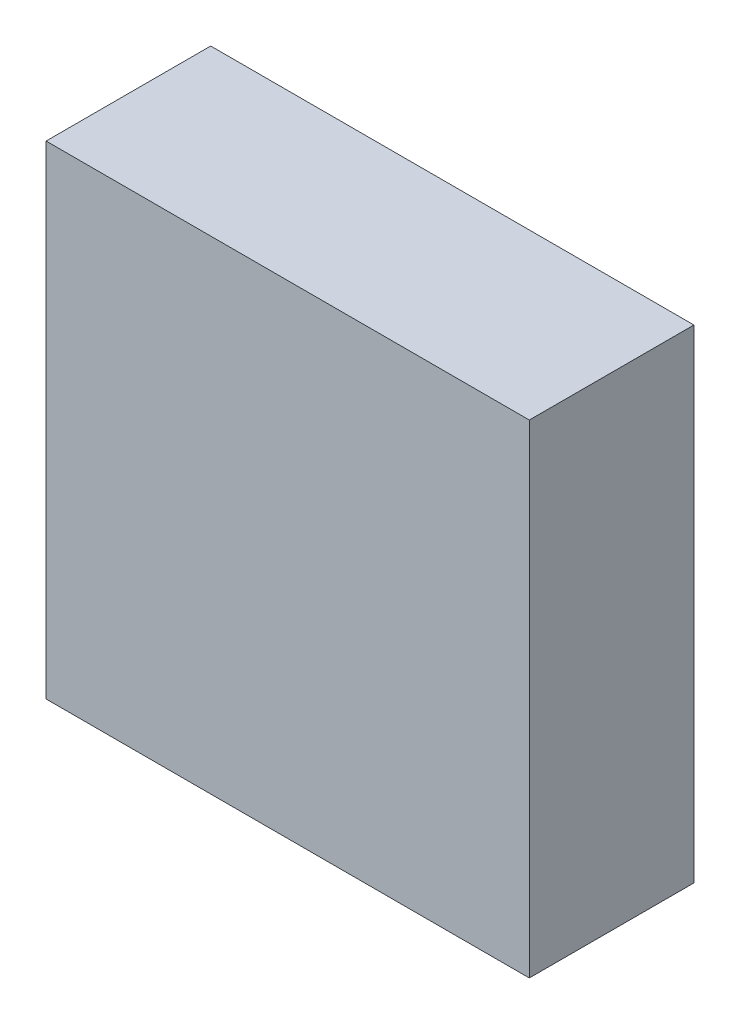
ISO-10303-21;
HEADER;
FILE_DESCRIPTION(('STEP AP214'),'2;1');
FILE_NAME('part.step','',(''),(''),'','','');
FILE_SCHEMA(('AUTOMOTIVE_DESIGN { 1 0 10303 214 1 1 1 1 }'));
ENDSEC;
DATA;
#1=APPLICATION_CONTEXT('core data for automotive mechanical design processes');
#2=APPLICATION_PROTOCOL_DEFINITION('international standard','automotive_design',2000,#1);
#3=PRODUCT_CONTEXT('',#1,'mechanical');
#4=PRODUCT('Part','Part','',(#3));
#5=PRODUCT_RELATED_PRODUCT_CATEGORY('part','',(#4));
#6=PRODUCT_DEFINITION_FORMATION('','',#4);
#7=PRODUCT_DEFINITION_CONTEXT('part definition',#1,'design');
#8=PRODUCT_DEFINITION('design','',#6,#7);
#9=PRODUCT_DEFINITION_SHAPE('','',#8);
#10=(LENGTH_UNIT() NAMED_UNIT(*) SI_UNIT(.MILLI.,.METRE.));
#11=(NAMED_UNIT(*) PLANE_ANGLE_UNIT() SI_UNIT($,.RADIAN.));
#12=(NAMED_UNIT(*) SI_UNIT($,.STERADIAN.) SOLID_ANGLE_UNIT());
#13=UNCERTAINTY_MEASURE_WITH_UNIT(LENGTH_MEASURE(1.E-05),#10,'distance_accuracy_value','');
#14=(GEOMETRIC_REPRESENTATION_CONTEXT(3) GLOBAL_UNCERTAINTY_ASSIGNED_CONTEXT((#13)) GLOBAL_UNIT_ASSIGNED_CONTEXT((#10,
#11,#12)) REPRESENTATION_CONTEXT('',''));
#15=CARTESIAN_POINT('',(0.,0.,0.));
#16=DIRECTION('',(0.,0.,1.));
#17=DIRECTION('',(1.,0.,0.));
#18=AXIS2_PLACEMENT_3D('',#15,#16,#17);
#19=CARTESIAN_POINT('',(1.59999934,-1.59999934,1.09));
#20=DIRECTION('',(0.,0.,1.));
#21=DIRECTION('',(1.,0.,0.));
#22=AXIS2_PLACEMENT_3D('',#19,#20,#21);
#23=PLANE('',#22);
#24=DIRECTION('',(0.,1.,0.));
#25=VECTOR('',#24,1.);
#26=CARTESIAN_POINT('',(-1.59999934,-1.59999934,1.09));
#27=LINE('',#26,#25);
#28=CARTESIAN_POINT('',(-1.59999934,-1.59999934,1.09));
#29=VERTEX_POINT('',#28);
#30=CARTESIAN_POINT('',(-1.59999934,1.59999934,1.09));
#31=VERTEX_POINT('',#30);
#32=EDGE_CURVE('E53',#29,#31,#27,.T.);
#33=ORIENTED_EDGE('',*,*,#32,.F.);
#34=DIRECTION('',(1.,0.,0.));
#35=VECTOR('',#34,1.);
#36=CARTESIAN_POINT('',(1.59999934,-1.59999934,1.09));
#37=LINE('',#36,#35);
#38=CARTESIAN_POINT('',(1.59999934,-1.59999934,1.09));
#39=VERTEX_POINT('',#38);
#40=EDGE_CURVE('E68',#39,#29,#37,.F.);
#41=ORIENTED_EDGE('',*,*,#40,.F.);
#42=DIRECTION('',(0.,1.,0.));
#43=VECTOR('',#42,1.);
#44=CARTESIAN_POINT('',(1.59999934,1.59999934,1.09));
#45=LINE('',#44,#43);
#46=CARTESIAN_POINT('',(1.59999934,1.59999934,1.09));
#47=VERTEX_POINT('',#46);
#48=EDGE_CURVE('E20',#47,#39,#45,.F.);
#49=ORIENTED_EDGE('',*,*,#48,.F.);
#50=DIRECTION('',(1.,0.,0.));
#51=VECTOR('',#50,1.);
#52=CARTESIAN_POINT('',(-1.59999934,1.59999934,1.09));
#53=LINE('',#52,#51);
#54=EDGE_CURVE('E58',#31,#47,#53,.T.);
#55=ORIENTED_EDGE('',*,*,#54,.F.);
#56=EDGE_LOOP('',(#33,#41,#49,#55));
#57=FACE_BOUND('',#56,.T.);
#58=ADVANCED_FACE('F17',(#57),#23,.T.);
#59=CARTESIAN_POINT('',(1.59999934,1.59999934,0.));
#60=DIRECTION('',(1.,0.,0.));
#61=DIRECTION('',(0.,0.,-1.));
#62=AXIS2_PLACEMENT_3D('',#59,#60,#61);
#63=PLANE('',#62);
#64=DIRECTION('',(0.,0.,-1.));
#65=VECTOR('',#64,1.);
#66=CARTESIAN_POINT('',(1.59999934,-1.59999934,0.));
#67=LINE('',#66,#65);
#68=CARTESIAN_POINT('',(1.59999934,-1.59999934,0.));
#69=VERTEX_POINT('',#68);
#70=EDGE_CURVE('E79',#69,#39,#67,.F.);
#71=ORIENTED_EDGE('',*,*,#70,.F.);
#72=DIRECTION('',(0.,1.,0.));
#73=VECTOR('',#72,1.);
#74=CARTESIAN_POINT('',(1.59999934,-1.59999934,0.));
#75=LINE('',#74,#73);
#76=CARTESIAN_POINT('',(1.59999934,1.59999934,0.));
#77=VERTEX_POINT('',#76);
#78=EDGE_CURVE('E74',#69,#77,#75,.T.);
#79=ORIENTED_EDGE('',*,*,#78,.T.);
#80=DIRECTION('',(0.,0.,1.));
#81=VECTOR('',#80,1.);
#82=CARTESIAN_POINT('',(1.59999934,1.59999934,0.));
#83=LINE('',#82,#81);
#84=EDGE_CURVE('E63',#47,#77,#83,.F.);
#85=ORIENTED_EDGE('',*,*,#84,.F.);
#86=ORIENTED_EDGE('',*,*,#48,.T.);
#87=EDGE_LOOP('',(#71,#79,#85,#86));
#88=FACE_BOUND('',#87,.T.);
#89=ADVANCED_FACE('F73',(#88),#63,.T.);
#90=CARTESIAN_POINT('',(-1.59999934,1.59999934,0.));
#91=DIRECTION('',(0.,1.,0.));
#92=DIRECTION('',(0.,0.,1.));
#93=AXIS2_PLACEMENT_3D('',#90,#91,#92);
#94=PLANE('',#93);
#95=ORIENTED_EDGE('',*,*,#84,.T.);
#96=DIRECTION('',(1.,0.,0.));
#97=VECTOR('',#96,1.);
#98=CARTESIAN_POINT('',(1.59999934,1.59999934,0.));
#99=LINE('',#98,#97);
#100=CARTESIAN_POINT('',(-1.59999934,1.59999934,0.));
#101=VERTEX_POINT('',#100);
#102=EDGE_CURVE('E84',#77,#101,#99,.F.);
#103=ORIENTED_EDGE('',*,*,#102,.T.);
#104=DIRECTION('',(0.,0.,1.));
#105=VECTOR('',#104,1.);
#106=CARTESIAN_POINT('',(-1.59999934,1.59999934,0.));
#107=LINE('',#106,#105);
#108=EDGE_CURVE('E65',#31,#101,#107,.F.);
#109=ORIENTED_EDGE('',*,*,#108,.F.);
#110=ORIENTED_EDGE('',*,*,#54,.T.);
#111=EDGE_LOOP('',(#95,#103,#109,#110));
#112=FACE_BOUND('',#111,.T.);
#113=ADVANCED_FACE('F60',(#112),#94,.T.);
#114=CARTESIAN_POINT('',(-1.59999934,-1.59999934,0.));
#115=DIRECTION('',(-1.,0.,0.));
#116=DIRECTION('',(0.,0.,1.));
#117=AXIS2_PLACEMENT_3D('',#114,#115,#116);
#118=PLANE('',#117);
#119=ORIENTED_EDGE('',*,*,#108,.T.);
#120=DIRECTION('',(0.,1.,0.));
#121=VECTOR('',#120,1.);
#122=CARTESIAN_POINT('',(-1.59999934,-1.59999934,0.));
#123=LINE('',#122,#121);
#124=CARTESIAN_POINT('',(-1.59999934,-1.59999934,0.));
#125=VERTEX_POINT('',#124);
#126=EDGE_CURVE('E26',#101,#125,#123,.F.);
#127=ORIENTED_EDGE('',*,*,#126,.T.);
#128=DIRECTION('',(0.,0.,-1.));
#129=VECTOR('',#128,1.);
#130=CARTESIAN_POINT('',(-1.59999934,-1.59999934,0.));
#131=LINE('',#130,#129);
#132=EDGE_CURVE('E34',#29,#125,#131,.T.);
#133=ORIENTED_EDGE('',*,*,#132,.F.);
#134=ORIENTED_EDGE('',*,*,#32,.T.);
#135=EDGE_LOOP('',(#119,#127,#133,#134));
#136=FACE_BOUND('',#135,.T.);
#137=ADVANCED_FACE('F88',(#136),#118,.T.);
#138=CARTESIAN_POINT('',(1.59999934,-1.59999934,0.));
#139=DIRECTION('',(0.,-1.,0.));
#140=DIRECTION('',(0.,0.,-1.));
#141=AXIS2_PLACEMENT_3D('',#138,#139,#140);
#142=PLANE('',#141);
#143=ORIENTED_EDGE('',*,*,#132,.T.);
#144=DIRECTION('',(1.,0.,0.));
#145=VECTOR('',#144,1.);
#146=CARTESIAN_POINT('',(1.59999934,-1.59999934,0.));
#147=LINE('',#146,#145);
#148=EDGE_CURVE('E11',#125,#69,#147,.T.);
#149=ORIENTED_EDGE('',*,*,#148,.T.);
#150=ORIENTED_EDGE('',*,*,#70,.T.);
#151=ORIENTED_EDGE('',*,*,#40,.T.);
#152=EDGE_LOOP('',(#143,#149,#150,#151));
#153=FACE_BOUND('',#152,.T.);
#154=ADVANCED_FACE('F91',(#153),#142,.T.);
#155=CARTESIAN_POINT('',(1.59999934,-1.59999934,0.));
#156=DIRECTION('',(0.,0.,1.));
#157=DIRECTION('',(1.,0.,0.));
#158=AXIS2_PLACEMENT_3D('',#155,#156,#157);
#159=PLANE('',#158);
#160=ORIENTED_EDGE('',*,*,#126,.F.);
#161=ORIENTED_EDGE('',*,*,#102,.F.);
#162=ORIENTED_EDGE('',*,*,#78,.F.);
#163=ORIENTED_EDGE('',*,*,#148,.F.);
#164=EDGE_LOOP('',(#160,#161,#162,#163));
#165=FACE_BOUND('',#164,.T.);
#166=ADVANCED_FACE('F90',(#165),#159,.F.);
#167=CLOSED_SHELL('',(#58,#89,#113,#137,#154,#166));
#168=MANIFOLD_SOLID_BREP('B1',#167);
#169=ADVANCED_BREP_SHAPE_REPRESENTATION('',(#18,#168),#14);
#170=SHAPE_DEFINITION_REPRESENTATION(#9,#169);
ENDSEC;
END-ISO-10303-21;
